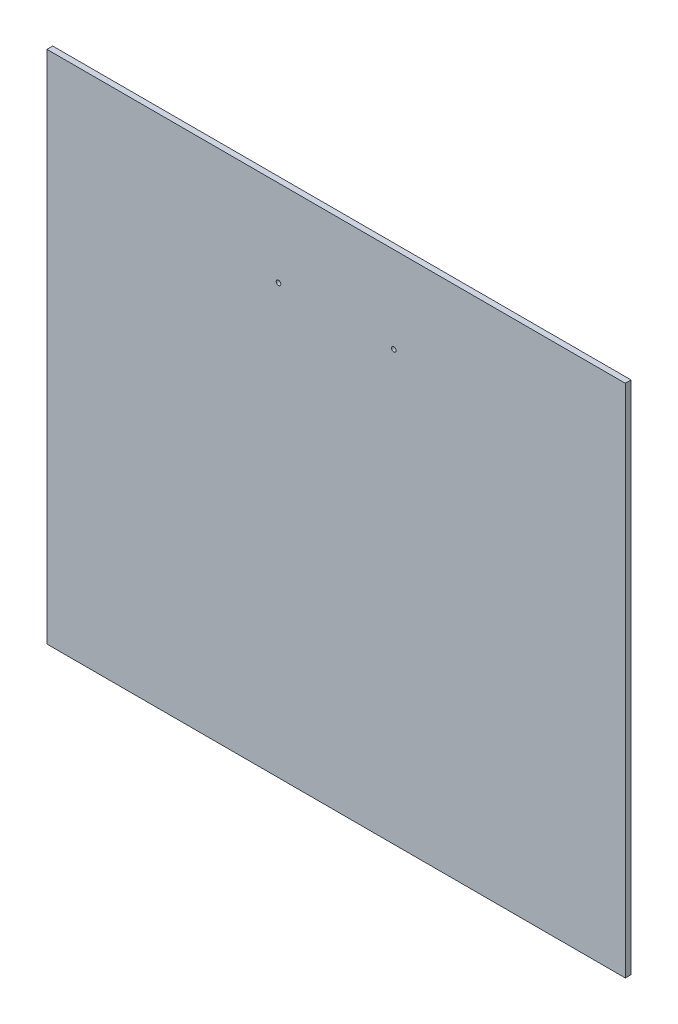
from build123d import *

# Parameters (mm, degrees)
SKETCH_1_W          = 1004
SKETCH_1_H          = 894
EXTRUDE_1_DEPTH     = 10
SKETCH_2_R          = 4
CUT_EXTRUDE_1_DEPTH = 1026.348721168


with BuildPart() as part:
    # Sketch 1 → Extrude 1 (new body)
    with BuildSketch(Plane.XY):
        with Locations((0, -447)):
            Rectangle(SKETCH_1_W, SKETCH_1_H)
    extrude(amount=EXTRUDE_1_DEPTH)

    # Sketch 2 → Cut-Extrude 1 (cut, through all)
    with BuildSketch(Plane.XY.offset(10)):
        with Locations((-100, -150)):
            Circle(SKETCH_2_R)
        with Locations((100, -150)):
            Circle(SKETCH_2_R)
    extrude(amount=-CUT_EXTRUDE_1_DEPTH, mode=Mode.SUBTRACT)


solid = part.part
